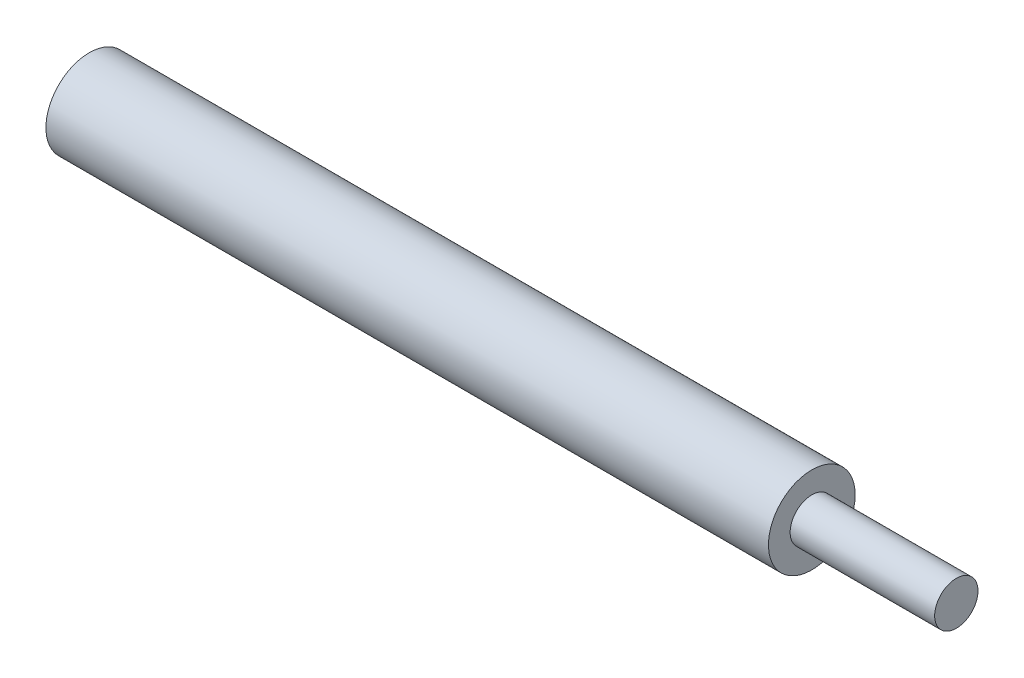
ISO-10303-21;
HEADER;
FILE_DESCRIPTION(('STEP AP214'),'2;1');
FILE_NAME('part.step','',(''),(''),'','','');
FILE_SCHEMA(('AUTOMOTIVE_DESIGN { 1 0 10303 214 1 1 1 1 }'));
ENDSEC;
DATA;
#1=APPLICATION_CONTEXT('core data for automotive mechanical design processes');
#2=APPLICATION_PROTOCOL_DEFINITION('international standard','automotive_design',2000,#1);
#3=PRODUCT_CONTEXT('',#1,'mechanical');
#4=PRODUCT('Part','Part','',(#3));
#5=PRODUCT_RELATED_PRODUCT_CATEGORY('part','',(#4));
#6=PRODUCT_DEFINITION_FORMATION('','',#4);
#7=PRODUCT_DEFINITION_CONTEXT('part definition',#1,'design');
#8=PRODUCT_DEFINITION('design','',#6,#7);
#9=PRODUCT_DEFINITION_SHAPE('','',#8);
#10=(LENGTH_UNIT() NAMED_UNIT(*) SI_UNIT(.MILLI.,.METRE.));
#11=(NAMED_UNIT(*) PLANE_ANGLE_UNIT() SI_UNIT($,.RADIAN.));
#12=(NAMED_UNIT(*) SI_UNIT($,.STERADIAN.) SOLID_ANGLE_UNIT());
#13=UNCERTAINTY_MEASURE_WITH_UNIT(LENGTH_MEASURE(1.E-05),#10,'distance_accuracy_value','');
#14=(GEOMETRIC_REPRESENTATION_CONTEXT(3) GLOBAL_UNCERTAINTY_ASSIGNED_CONTEXT((#13)) GLOBAL_UNIT_ASSIGNED_CONTEXT((#10,
#11,#12)) REPRESENTATION_CONTEXT('',''));
#15=CARTESIAN_POINT('',(0.,0.,0.));
#16=DIRECTION('',(0.,0.,1.));
#17=DIRECTION('',(1.,0.,0.));
#18=AXIS2_PLACEMENT_3D('',#15,#16,#17);
#19=CARTESIAN_POINT('',(0.,0.,0.));
#20=DIRECTION('',(1.,0.,0.));
#21=DIRECTION('',(0.,0.,-1.));
#22=AXIS2_PLACEMENT_3D('',#19,#20,#21);
#23=PLANE('',#22);
#24=CARTESIAN_POINT('',(0.,0.,0.));
#25=DIRECTION('',(1.,0.,0.));
#26=DIRECTION('',(0.,0.,-1.));
#27=AXIS2_PLACEMENT_3D('',#24,#25,#26);
#28=CIRCLE('',#27,3.);
#29=CARTESIAN_POINT('',(0.,0.,-3.00000000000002));
#30=VERTEX_POINT('',#29);
#31=EDGE_CURVE('E46',#30,#30,#28,.T.);
#32=ORIENTED_EDGE('',*,*,#31,.T.);
#33=EDGE_LOOP('',(#32));
#34=FACE_BOUND('',#33,.T.);
#35=CARTESIAN_POINT('',(0.,0.,0.));
#36=DIRECTION('',(1.,0.,0.));
#37=DIRECTION('',(0.,0.,-1.));
#38=AXIS2_PLACEMENT_3D('',#35,#36,#37);
#39=CIRCLE('',#38,1.5);
#40=CARTESIAN_POINT('',(0.,0.,-1.50000000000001));
#41=VERTEX_POINT('',#40);
#42=EDGE_CURVE('E57',#41,#41,#39,.T.);
#43=ORIENTED_EDGE('',*,*,#42,.F.);
#44=EDGE_LOOP('',(#43));
#45=FACE_BOUND('',#44,.T.);
#46=ADVANCED_FACE('F38',(#34,#45),#23,.T.);
#47=CARTESIAN_POINT('',(-50.,0.,0.));
#48=DIRECTION('',(1.,0.,0.));
#49=DIRECTION('',(0.,0.,-1.));
#50=AXIS2_PLACEMENT_3D('',#47,#48,#49);
#51=CYLINDRICAL_SURFACE('',#50,3.);
#52=CARTESIAN_POINT('',(-50.,0.,0.));
#53=DIRECTION('',(1.,0.,0.));
#54=DIRECTION('',(0.,0.,-1.));
#55=AXIS2_PLACEMENT_3D('',#52,#53,#54);
#56=CIRCLE('',#55,3.);
#57=CARTESIAN_POINT('',(-50.,0.,-3.));
#58=VERTEX_POINT('',#57);
#59=EDGE_CURVE('E10',#58,#58,#56,.T.);
#60=ORIENTED_EDGE('',*,*,#59,.T.);
#61=EDGE_LOOP('',(#60));
#62=FACE_BOUND('',#61,.T.);
#63=ORIENTED_EDGE('',*,*,#31,.F.);
#64=EDGE_LOOP('',(#63));
#65=FACE_BOUND('',#64,.T.);
#66=ADVANCED_FACE('F40',(#62,#65),#51,.T.);
#67=CARTESIAN_POINT('',(-50.,0.,0.));
#68=DIRECTION('',(1.,0.,0.));
#69=DIRECTION('',(0.,0.,-1.));
#70=AXIS2_PLACEMENT_3D('',#67,#68,#69);
#71=PLANE('',#70);
#72=ORIENTED_EDGE('',*,*,#59,.F.);
#73=EDGE_LOOP('',(#72));
#74=FACE_BOUND('',#73,.T.);
#75=ADVANCED_FACE('F70',(#74),#71,.F.);
#76=CARTESIAN_POINT('',(10.,0.,0.));
#77=DIRECTION('',(-1.,0.,0.));
#78=DIRECTION('',(0.,0.,1.));
#79=AXIS2_PLACEMENT_3D('',#76,#77,#78);
#80=CYLINDRICAL_SURFACE('',#79,1.5);
#81=CARTESIAN_POINT('',(10.,0.,0.));
#82=DIRECTION('',(1.,0.,0.));
#83=DIRECTION('',(0.,0.,-1.));
#84=AXIS2_PLACEMENT_3D('',#81,#82,#83);
#85=CIRCLE('',#84,1.5);
#86=CARTESIAN_POINT('',(10.,0.,-1.50000000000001));
#87=VERTEX_POINT('',#86);
#88=EDGE_CURVE('E52',#87,#87,#85,.T.);
#89=ORIENTED_EDGE('',*,*,#88,.F.);
#90=EDGE_LOOP('',(#89));
#91=FACE_BOUND('',#90,.T.);
#92=ORIENTED_EDGE('',*,*,#42,.T.);
#93=EDGE_LOOP('',(#92));
#94=FACE_BOUND('',#93,.T.);
#95=ADVANCED_FACE('F63',(#91,#94),#80,.T.);
#96=CARTESIAN_POINT('',(10.,0.,0.));
#97=DIRECTION('',(1.,0.,0.));
#98=DIRECTION('',(0.,0.,-1.));
#99=AXIS2_PLACEMENT_3D('',#96,#97,#98);
#100=PLANE('',#99);
#101=ORIENTED_EDGE('',*,*,#88,.T.);
#102=EDGE_LOOP('',(#101));
#103=FACE_BOUND('',#102,.T.);
#104=ADVANCED_FACE('F78',(#103),#100,.T.);
#105=CLOSED_SHELL('',(#46,#66,#75,#95,#104));
#106=MANIFOLD_SOLID_BREP('B2',#105);
#107=ADVANCED_BREP_SHAPE_REPRESENTATION('',(#18,#106),#14);
#108=SHAPE_DEFINITION_REPRESENTATION(#9,#107);
ENDSEC;
END-ISO-10303-21;
